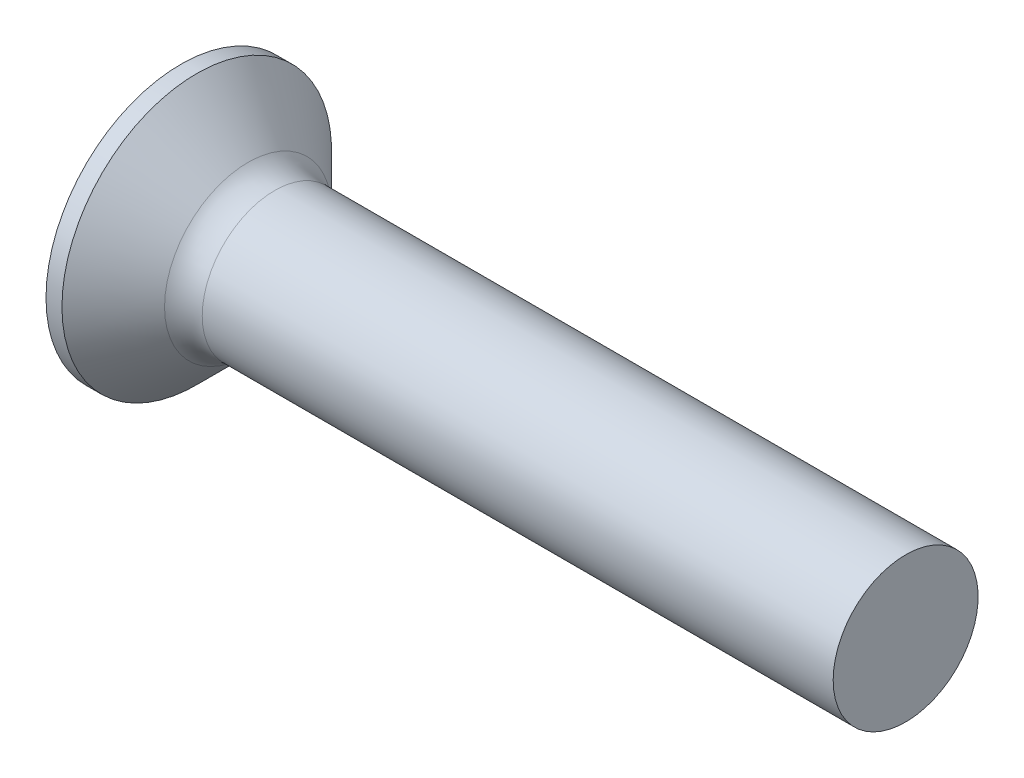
from build123d import *

# Parameters (mm, degrees)
FILLET1_R    = 1.3
RECPAT_COUNT = 2
RECPAT_ANGLE = 90


with BuildPart() as part:
    # BodySke → Base-Revolve (revolve)
    with BuildSketch(Plane.XY, mode=Mode.PRIVATE) as base_revolve_sk:
        Polygon((0, 0), (0, 4.65), (0.55, 4.65), (2.7, 2.5), (25, 2.5), (25, 0), align=None)
    revolve(base_revolve_sk.sketch.rotate(Axis((-6.35, 0, 0), (1, 0, 0)), 90), axis=Axis((-6.35, 0, 0), (1, 0, 0)))

    # Fillet1
    fillet1_edges = [part.edges().sort_by_distance(p)[0] for p in [
        (2.7, 0, -2.5),
    ]]
    fillet(fillet1_edges, radius=FILLET1_R)

    # Sketch3 → Recess section 0
    with BuildSketch(Plane.ZY):
        with BuildLine():
            Line((-0.515, 2.45), (0.515, 2.45))
            Line((0.515, 2.45), (0.515, -2.45))
            Line((0.515, -2.45), (-0.515, -2.45))
            Line((-0.515, -2.45), (-0.515, 2.45))
        make_face()
    # Sketch4 → Recess section 1
    with BuildSketch(Plane.ZY.offset(-3.05)):
        with BuildLine():
            Line((-0.515, 0.92932635), (0.515, 0.92932635))
            Line((0.515, 0.92932635), (0.515, -0.92932635))
            Line((0.515, -0.92932635), (-0.515, -0.92932635))
            Line((-0.515, -0.92932635), (-0.515, 0.92932635))
        make_face()
    recess = loft(mode=Mode.SUBTRACT)

    # RecPat: Recess ×2 about axis
    recpat_axis = Axis((0, 0, 0), (1, 0, 0))
    for i in range(1, RECPAT_COUNT):
        add(recess.rotate(recpat_axis, i * RECPAT_ANGLE / (RECPAT_COUNT - 1)), mode=Mode.SUBTRACT)

    # RecCorSke → RecessCore (revolve, cut)
    with BuildSketch(Plane.XY, mode=Mode.PRIVATE) as recesscore_sk:
        Polygon((0, 0), (0, 1.064276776), (3.05, 0.851), (3.326506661, 0), align=None)
    revolve(recesscore_sk.sketch.rotate(Axis((-3.175, 0, 0), (1, 0, 0)), 90), axis=Axis((-3.175, 0, 0), (1, 0, 0)), mode=Mode.SUBTRACT)


solid = part.part
